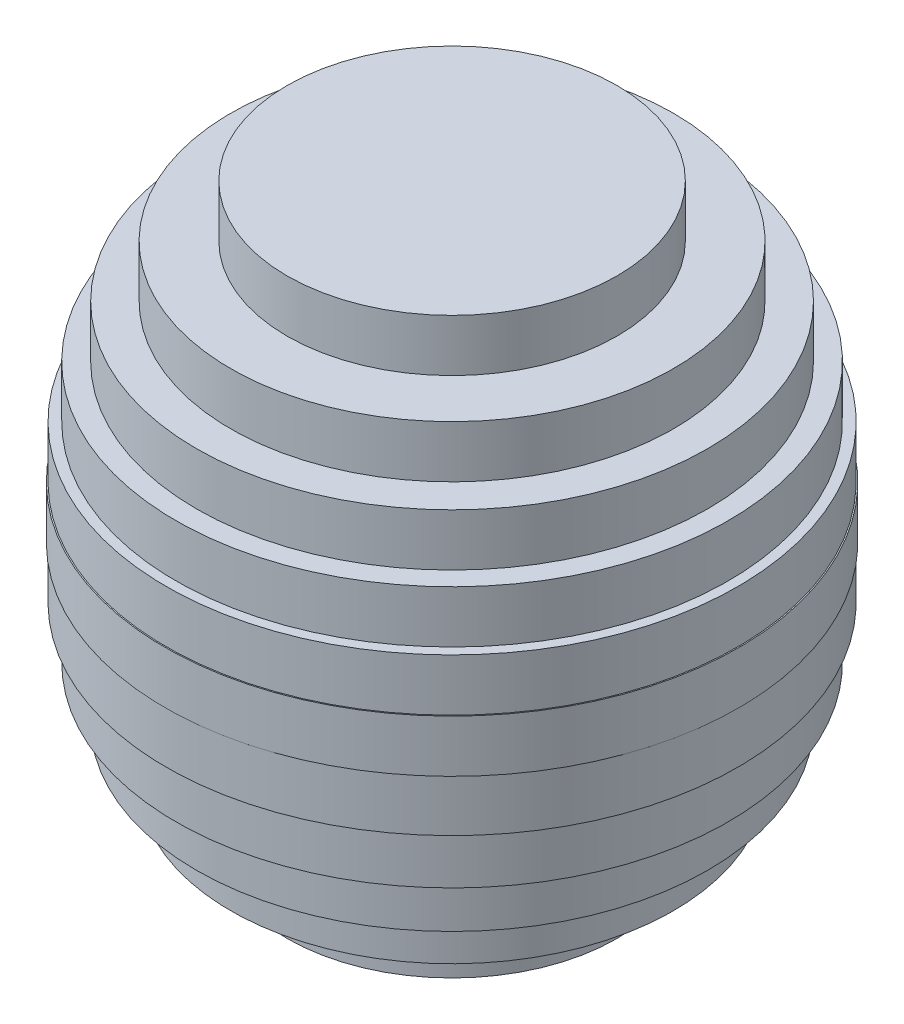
ISO-10303-21;
HEADER;
FILE_DESCRIPTION(('STEP AP214'),'2;1');
FILE_NAME('part.step','',(''),(''),'','','');
FILE_SCHEMA(('AUTOMOTIVE_DESIGN { 1 0 10303 214 1 1 1 1 }'));
ENDSEC;
DATA;
#1=APPLICATION_CONTEXT('core data for automotive mechanical design processes');
#2=APPLICATION_PROTOCOL_DEFINITION('international standard','automotive_design',2000,#1);
#3=PRODUCT_CONTEXT('',#1,'mechanical');
#4=PRODUCT('Part','Part','',(#3));
#5=PRODUCT_RELATED_PRODUCT_CATEGORY('part','',(#4));
#6=PRODUCT_DEFINITION_FORMATION('','',#4);
#7=PRODUCT_DEFINITION_CONTEXT('part definition',#1,'design');
#8=PRODUCT_DEFINITION('design','',#6,#7);
#9=PRODUCT_DEFINITION_SHAPE('','',#8);
#10=(LENGTH_UNIT() NAMED_UNIT(*) SI_UNIT(.MILLI.,.METRE.));
#11=(NAMED_UNIT(*) PLANE_ANGLE_UNIT() SI_UNIT($,.RADIAN.));
#12=(NAMED_UNIT(*) SI_UNIT($,.STERADIAN.) SOLID_ANGLE_UNIT());
#13=UNCERTAINTY_MEASURE_WITH_UNIT(LENGTH_MEASURE(1.E-05),#10,'distance_accuracy_value','');
#14=(GEOMETRIC_REPRESENTATION_CONTEXT(3) GLOBAL_UNCERTAINTY_ASSIGNED_CONTEXT((#13)) GLOBAL_UNIT_ASSIGNED_CONTEXT((#10,
#11,#12)) REPRESENTATION_CONTEXT('',''));
#15=CARTESIAN_POINT('',(0.,0.,0.));
#16=DIRECTION('',(0.,0.,1.));
#17=DIRECTION('',(1.,0.,0.));
#18=AXIS2_PLACEMENT_3D('',#15,#16,#17);
#19=CARTESIAN_POINT('',(27.3861278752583,2.49999999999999,0.));
#20=DIRECTION('',(0.,1.,0.));
#21=DIRECTION('',(0.,0.,1.));
#22=AXIS2_PLACEMENT_3D('',#19,#20,#21);
#23=PLANE('',#22);
#24=CARTESIAN_POINT('',(0.,2.49999999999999,0.));
#25=DIRECTION('',(0.,-1.,0.));
#26=DIRECTION('',(0.,0.,-1.));
#27=AXIS2_PLACEMENT_3D('',#24,#25,#26);
#28=CIRCLE('',#27,27.3861278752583);
#29=CARTESIAN_POINT('',(0.,2.49999999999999,-27.3861278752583));
#30=VERTEX_POINT('',#29);
#31=EDGE_CURVE('E100',#30,#30,#28,.T.);
#32=ORIENTED_EDGE('',*,*,#31,.T.);
#33=EDGE_LOOP('',(#32));
#34=FACE_BOUND('',#33,.T.);
#35=CARTESIAN_POINT('',(0.,2.49999999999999,0.));
#36=DIRECTION('',(0.,-1.,0.));
#37=DIRECTION('',(0.,0.,-1.));
#38=AXIS2_PLACEMENT_3D('',#35,#36,#37);
#39=CIRCLE('',#38,27.4999999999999);
#40=CARTESIAN_POINT('',(0.,2.49999999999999,-27.4999999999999));
#41=VERTEX_POINT('',#40);
#42=EDGE_CURVE('E10',#41,#41,#39,.T.);
#43=ORIENTED_EDGE('',*,*,#42,.F.);
#44=EDGE_LOOP('',(#43));
#45=FACE_BOUND('',#44,.T.);
#46=ADVANCED_FACE('F30',(#34,#45),#23,.T.);
#47=CARTESIAN_POINT('',(0.,-27.5,0.));
#48=DIRECTION('',(0.,-1.,0.));
#49=DIRECTION('',(0.,0.,-1.));
#50=AXIS2_PLACEMENT_3D('',#47,#48,#49);
#51=CYLINDRICAL_SURFACE('',#50,27.4999999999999);
#52=ORIENTED_EDGE('',*,*,#42,.T.);
#53=EDGE_LOOP('',(#52));
#54=FACE_BOUND('',#53,.T.);
#55=CARTESIAN_POINT('',(0.,-2.50000000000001,0.));
#56=DIRECTION('',(0.,-1.,0.));
#57=DIRECTION('',(0.,0.,-1.));
#58=AXIS2_PLACEMENT_3D('',#55,#56,#57);
#59=CIRCLE('',#58,27.4999999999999);
#60=CARTESIAN_POINT('',(0.,-2.50000000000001,-27.4999999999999));
#61=VERTEX_POINT('',#60);
#62=EDGE_CURVE('E36',#61,#61,#59,.T.);
#63=ORIENTED_EDGE('',*,*,#62,.F.);
#64=EDGE_LOOP('',(#63));
#65=FACE_BOUND('',#64,.T.);
#66=ADVANCED_FACE('F118',(#54,#65),#51,.T.);
#67=CARTESIAN_POINT('',(27.4999999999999,-2.50000000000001,0.));
#68=DIRECTION('',(0.,-1.,0.));
#69=DIRECTION('',(0.,0.,-1.));
#70=AXIS2_PLACEMENT_3D('',#67,#68,#69);
#71=PLANE('',#70);
#72=ORIENTED_EDGE('',*,*,#62,.T.);
#73=EDGE_LOOP('',(#72));
#74=FACE_BOUND('',#73,.T.);
#75=CARTESIAN_POINT('',(0.,-2.50000000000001,0.));
#76=DIRECTION('',(0.,-1.,0.));
#77=DIRECTION('',(0.,0.,-1.));
#78=AXIS2_PLACEMENT_3D('',#75,#76,#77);
#79=CIRCLE('',#78,27.3861278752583);
#80=CARTESIAN_POINT('',(0.,-2.50000000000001,-27.3861278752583));
#81=VERTEX_POINT('',#80);
#82=EDGE_CURVE('E40',#81,#81,#79,.T.);
#83=ORIENTED_EDGE('',*,*,#82,.F.);
#84=EDGE_LOOP('',(#83));
#85=FACE_BOUND('',#84,.T.);
#86=ADVANCED_FACE('F122',(#74,#85),#71,.T.);
#87=CARTESIAN_POINT('',(0.,-27.5,0.));
#88=DIRECTION('',(0.,-1.,0.));
#89=DIRECTION('',(0.,0.,-1.));
#90=AXIS2_PLACEMENT_3D('',#87,#88,#89);
#91=CYLINDRICAL_SURFACE('',#90,27.3861278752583);
#92=ORIENTED_EDGE('',*,*,#82,.T.);
#93=EDGE_LOOP('',(#92));
#94=FACE_BOUND('',#93,.T.);
#95=CARTESIAN_POINT('',(0.,-7.50000000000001,0.));
#96=DIRECTION('',(0.,-1.,0.));
#97=DIRECTION('',(0.,0.,-1.));
#98=AXIS2_PLACEMENT_3D('',#95,#96,#97);
#99=CIRCLE('',#98,27.3861278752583);
#100=CARTESIAN_POINT('',(0.,-7.50000000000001,-27.3861278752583));
#101=VERTEX_POINT('',#100);
#102=EDGE_CURVE('E44',#101,#101,#99,.T.);
#103=ORIENTED_EDGE('',*,*,#102,.F.);
#104=EDGE_LOOP('',(#103));
#105=FACE_BOUND('',#104,.T.);
#106=ADVANCED_FACE('F126',(#94,#105),#91,.T.);
#107=CARTESIAN_POINT('',(27.3861278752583,-7.50000000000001,0.));
#108=DIRECTION('',(0.,-1.,0.));
#109=DIRECTION('',(0.,0.,-1.));
#110=AXIS2_PLACEMENT_3D('',#107,#108,#109);
#111=PLANE('',#110);
#112=ORIENTED_EDGE('',*,*,#102,.T.);
#113=EDGE_LOOP('',(#112));
#114=FACE_BOUND('',#113,.T.);
#115=CARTESIAN_POINT('',(0.,-7.50000000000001,0.));
#116=DIRECTION('',(0.,-1.,0.));
#117=DIRECTION('',(0.,0.,-1.));
#118=AXIS2_PLACEMENT_3D('',#115,#116,#117);
#119=CIRCLE('',#118,26.4575131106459);
#120=CARTESIAN_POINT('',(0.,-7.50000000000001,-26.4575131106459));
#121=VERTEX_POINT('',#120);
#122=EDGE_CURVE('E49',#121,#121,#119,.T.);
#123=ORIENTED_EDGE('',*,*,#122,.F.);
#124=EDGE_LOOP('',(#123));
#125=FACE_BOUND('',#124,.T.);
#126=ADVANCED_FACE('F132',(#114,#125),#111,.T.);
#127=CARTESIAN_POINT('',(0.,-27.5,0.));
#128=DIRECTION('',(0.,-1.,0.));
#129=DIRECTION('',(0.,0.,-1.));
#130=AXIS2_PLACEMENT_3D('',#127,#128,#129);
#131=CYLINDRICAL_SURFACE('',#130,26.4575131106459);
#132=ORIENTED_EDGE('',*,*,#122,.T.);
#133=EDGE_LOOP('',(#132));
#134=FACE_BOUND('',#133,.T.);
#135=CARTESIAN_POINT('',(0.,-12.5,0.));
#136=DIRECTION('',(0.,-1.,0.));
#137=DIRECTION('',(0.,0.,-1.));
#138=AXIS2_PLACEMENT_3D('',#135,#136,#137);
#139=CIRCLE('',#138,26.4575131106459);
#140=CARTESIAN_POINT('',(0.,-12.5,-26.4575131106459));
#141=VERTEX_POINT('',#140);
#142=EDGE_CURVE('E52',#141,#141,#139,.T.);
#143=ORIENTED_EDGE('',*,*,#142,.F.);
#144=EDGE_LOOP('',(#143));
#145=FACE_BOUND('',#144,.T.);
#146=ADVANCED_FACE('F136',(#134,#145),#131,.T.);
#147=CARTESIAN_POINT('',(26.4575131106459,-12.5,0.));
#148=DIRECTION('',(0.,-1.,0.));
#149=DIRECTION('',(0.,0.,-1.));
#150=AXIS2_PLACEMENT_3D('',#147,#148,#149);
#151=PLANE('',#150);
#152=ORIENTED_EDGE('',*,*,#142,.T.);
#153=EDGE_LOOP('',(#152));
#154=FACE_BOUND('',#153,.T.);
#155=CARTESIAN_POINT('',(0.,-12.5,0.));
#156=DIRECTION('',(0.,-1.,0.));
#157=DIRECTION('',(0.,0.,-1.));
#158=AXIS2_PLACEMENT_3D('',#155,#156,#157);
#159=CIRCLE('',#158,24.4948974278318);
#160=CARTESIAN_POINT('',(0.,-12.5,-24.4948974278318));
#161=VERTEX_POINT('',#160);
#162=EDGE_CURVE('E55',#161,#161,#159,.T.);
#163=ORIENTED_EDGE('',*,*,#162,.F.);
#164=EDGE_LOOP('',(#163));
#165=FACE_BOUND('',#164,.T.);
#166=ADVANCED_FACE('F140',(#154,#165),#151,.T.);
#167=CARTESIAN_POINT('',(0.,-27.5,0.));
#168=DIRECTION('',(0.,-1.,0.));
#169=DIRECTION('',(0.,0.,-1.));
#170=AXIS2_PLACEMENT_3D('',#167,#168,#169);
#171=CYLINDRICAL_SURFACE('',#170,24.4948974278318);
#172=ORIENTED_EDGE('',*,*,#162,.T.);
#173=EDGE_LOOP('',(#172));
#174=FACE_BOUND('',#173,.T.);
#175=CARTESIAN_POINT('',(0.,-17.5,0.));
#176=DIRECTION('',(0.,-1.,0.));
#177=DIRECTION('',(0.,0.,-1.));
#178=AXIS2_PLACEMENT_3D('',#175,#176,#177);
#179=CIRCLE('',#178,24.4948974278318);
#180=CARTESIAN_POINT('',(0.,-17.5,-24.4948974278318));
#181=VERTEX_POINT('',#180);
#182=EDGE_CURVE('E58',#181,#181,#179,.T.);
#183=ORIENTED_EDGE('',*,*,#182,.F.);
#184=EDGE_LOOP('',(#183));
#185=FACE_BOUND('',#184,.T.);
#186=ADVANCED_FACE('F144',(#174,#185),#171,.T.);
#187=CARTESIAN_POINT('',(24.4948974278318,-17.5,0.));
#188=DIRECTION('',(0.,-1.,0.));
#189=DIRECTION('',(0.,0.,-1.));
#190=AXIS2_PLACEMENT_3D('',#187,#188,#189);
#191=PLANE('',#190);
#192=ORIENTED_EDGE('',*,*,#182,.T.);
#193=EDGE_LOOP('',(#192));
#194=FACE_BOUND('',#193,.T.);
#195=CARTESIAN_POINT('',(0.,-17.5,0.));
#196=DIRECTION('',(0.,-1.,0.));
#197=DIRECTION('',(0.,0.,-1.));
#198=AXIS2_PLACEMENT_3D('',#195,#196,#197);
#199=CIRCLE('',#198,21.2132034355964);
#200=CARTESIAN_POINT('',(0.,-17.5,-21.2132034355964));
#201=VERTEX_POINT('',#200);
#202=EDGE_CURVE('E61',#201,#201,#199,.T.);
#203=ORIENTED_EDGE('',*,*,#202,.F.);
#204=EDGE_LOOP('',(#203));
#205=FACE_BOUND('',#204,.T.);
#206=ADVANCED_FACE('F148',(#194,#205),#191,.T.);
#207=CARTESIAN_POINT('',(0.,-27.5,0.));
#208=DIRECTION('',(0.,-1.,0.));
#209=DIRECTION('',(0.,0.,-1.));
#210=AXIS2_PLACEMENT_3D('',#207,#208,#209);
#211=CYLINDRICAL_SURFACE('',#210,21.2132034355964);
#212=ORIENTED_EDGE('',*,*,#202,.T.);
#213=EDGE_LOOP('',(#212));
#214=FACE_BOUND('',#213,.T.);
#215=CARTESIAN_POINT('',(0.,-22.5,0.));
#216=DIRECTION('',(0.,-1.,0.));
#217=DIRECTION('',(0.,0.,-1.));
#218=AXIS2_PLACEMENT_3D('',#215,#216,#217);
#219=CIRCLE('',#218,21.2132034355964);
#220=CARTESIAN_POINT('',(0.,-22.5,-21.2132034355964));
#221=VERTEX_POINT('',#220);
#222=EDGE_CURVE('E64',#221,#221,#219,.T.);
#223=ORIENTED_EDGE('',*,*,#222,.F.);
#224=EDGE_LOOP('',(#223));
#225=FACE_BOUND('',#224,.T.);
#226=ADVANCED_FACE('F152',(#214,#225),#211,.T.);
#227=CARTESIAN_POINT('',(21.2132034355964,-22.5,0.));
#228=DIRECTION('',(0.,-1.,0.));
#229=DIRECTION('',(0.,0.,-1.));
#230=AXIS2_PLACEMENT_3D('',#227,#228,#229);
#231=PLANE('',#230);
#232=ORIENTED_EDGE('',*,*,#222,.T.);
#233=EDGE_LOOP('',(#232));
#234=FACE_BOUND('',#233,.T.);
#235=CARTESIAN_POINT('',(0.,-22.5,0.));
#236=DIRECTION('',(0.,-1.,0.));
#237=DIRECTION('',(0.,0.,-1.));
#238=AXIS2_PLACEMENT_3D('',#235,#236,#237);
#239=CIRCLE('',#238,15.8113883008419);
#240=CARTESIAN_POINT('',(0.,-22.5,-15.8113883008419));
#241=VERTEX_POINT('',#240);
#242=EDGE_CURVE('E67',#241,#241,#239,.T.);
#243=ORIENTED_EDGE('',*,*,#242,.F.);
#244=EDGE_LOOP('',(#243));
#245=FACE_BOUND('',#244,.T.);
#246=ADVANCED_FACE('F156',(#234,#245),#231,.T.);
#247=CARTESIAN_POINT('',(0.,-27.5,0.));
#248=DIRECTION('',(0.,-1.,0.));
#249=DIRECTION('',(0.,0.,-1.));
#250=AXIS2_PLACEMENT_3D('',#247,#248,#249);
#251=CYLINDRICAL_SURFACE('',#250,15.8113883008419);
#252=ORIENTED_EDGE('',*,*,#242,.T.);
#253=EDGE_LOOP('',(#252));
#254=FACE_BOUND('',#253,.T.);
#255=CARTESIAN_POINT('',(0.,-27.5,0.));
#256=DIRECTION('',(0.,-1.,0.));
#257=DIRECTION('',(0.,0.,-1.));
#258=AXIS2_PLACEMENT_3D('',#255,#256,#257);
#259=CIRCLE('',#258,15.8113883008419);
#260=CARTESIAN_POINT('',(0.,-27.5,-15.8113883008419));
#261=VERTEX_POINT('',#260);
#262=EDGE_CURVE('E70',#261,#261,#259,.T.);
#263=ORIENTED_EDGE('',*,*,#262,.F.);
#264=EDGE_LOOP('',(#263));
#265=FACE_BOUND('',#264,.T.);
#266=ADVANCED_FACE('F160',(#254,#265),#251,.T.);
#267=CARTESIAN_POINT('',(15.8113883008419,-27.5,0.));
#268=DIRECTION('',(0.,-1.,0.));
#269=DIRECTION('',(0.,0.,-1.));
#270=AXIS2_PLACEMENT_3D('',#267,#268,#269);
#271=PLANE('',#270);
#272=ORIENTED_EDGE('',*,*,#262,.T.);
#273=EDGE_LOOP('',(#272));
#274=FACE_BOUND('',#273,.T.);
#275=ADVANCED_FACE('F164',(#274),#271,.T.);
#276=CARTESIAN_POINT('',(0.,27.5,0.));
#277=DIRECTION('',(0.,1.,0.));
#278=DIRECTION('',(0.,0.,1.));
#279=AXIS2_PLACEMENT_3D('',#276,#277,#278);
#280=PLANE('',#279);
#281=CARTESIAN_POINT('',(0.,27.5,0.));
#282=DIRECTION('',(0.,-1.,0.));
#283=DIRECTION('',(0.,0.,-1.));
#284=AXIS2_PLACEMENT_3D('',#281,#282,#283);
#285=CIRCLE('',#284,15.8113883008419);
#286=CARTESIAN_POINT('',(0.,27.5,-15.8113883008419));
#287=VERTEX_POINT('',#286);
#288=EDGE_CURVE('E73',#287,#287,#285,.T.);
#289=ORIENTED_EDGE('',*,*,#288,.F.);
#290=EDGE_LOOP('',(#289));
#291=FACE_BOUND('',#290,.T.);
#292=ADVANCED_FACE('F168',(#291),#280,.T.);
#293=CARTESIAN_POINT('',(0.,-27.5,0.));
#294=DIRECTION('',(0.,-1.,0.));
#295=DIRECTION('',(0.,0.,-1.));
#296=AXIS2_PLACEMENT_3D('',#293,#294,#295);
#297=CYLINDRICAL_SURFACE('',#296,15.8113883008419);
#298=ORIENTED_EDGE('',*,*,#288,.T.);
#299=EDGE_LOOP('',(#298));
#300=FACE_BOUND('',#299,.T.);
#301=CARTESIAN_POINT('',(0.,22.5,0.));
#302=DIRECTION('',(0.,-1.,0.));
#303=DIRECTION('',(0.,0.,-1.));
#304=AXIS2_PLACEMENT_3D('',#301,#302,#303);
#305=CIRCLE('',#304,15.8113883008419);
#306=CARTESIAN_POINT('',(0.,22.5,-15.8113883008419));
#307=VERTEX_POINT('',#306);
#308=EDGE_CURVE('E76',#307,#307,#305,.T.);
#309=ORIENTED_EDGE('',*,*,#308,.F.);
#310=EDGE_LOOP('',(#309));
#311=FACE_BOUND('',#310,.T.);
#312=ADVANCED_FACE('F172',(#300,#311),#297,.T.);
#313=CARTESIAN_POINT('',(15.8113883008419,22.5,0.));
#314=DIRECTION('',(0.,1.,0.));
#315=DIRECTION('',(0.,0.,1.));
#316=AXIS2_PLACEMENT_3D('',#313,#314,#315);
#317=PLANE('',#316);
#318=ORIENTED_EDGE('',*,*,#308,.T.);
#319=EDGE_LOOP('',(#318));
#320=FACE_BOUND('',#319,.T.);
#321=CARTESIAN_POINT('',(0.,22.5,0.));
#322=DIRECTION('',(0.,-1.,0.));
#323=DIRECTION('',(0.,0.,-1.));
#324=AXIS2_PLACEMENT_3D('',#321,#322,#323);
#325=CIRCLE('',#324,21.2132034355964);
#326=CARTESIAN_POINT('',(0.,22.5,-21.2132034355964));
#327=VERTEX_POINT('',#326);
#328=EDGE_CURVE('E79',#327,#327,#325,.T.);
#329=ORIENTED_EDGE('',*,*,#328,.F.);
#330=EDGE_LOOP('',(#329));
#331=FACE_BOUND('',#330,.T.);
#332=ADVANCED_FACE('F176',(#320,#331),#317,.T.);
#333=CARTESIAN_POINT('',(0.,-27.5,0.));
#334=DIRECTION('',(0.,-1.,0.));
#335=DIRECTION('',(0.,0.,-1.));
#336=AXIS2_PLACEMENT_3D('',#333,#334,#335);
#337=CYLINDRICAL_SURFACE('',#336,21.2132034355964);
#338=ORIENTED_EDGE('',*,*,#328,.T.);
#339=EDGE_LOOP('',(#338));
#340=FACE_BOUND('',#339,.T.);
#341=CARTESIAN_POINT('',(0.,17.5,0.));
#342=DIRECTION('',(0.,-1.,0.));
#343=DIRECTION('',(0.,0.,-1.));
#344=AXIS2_PLACEMENT_3D('',#341,#342,#343);
#345=CIRCLE('',#344,21.2132034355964);
#346=CARTESIAN_POINT('',(0.,17.5,-21.2132034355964));
#347=VERTEX_POINT('',#346);
#348=EDGE_CURVE('E82',#347,#347,#345,.T.);
#349=ORIENTED_EDGE('',*,*,#348,.F.);
#350=EDGE_LOOP('',(#349));
#351=FACE_BOUND('',#350,.T.);
#352=ADVANCED_FACE('F180',(#340,#351),#337,.T.);
#353=CARTESIAN_POINT('',(21.2132034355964,17.5,0.));
#354=DIRECTION('',(0.,1.,0.));
#355=DIRECTION('',(0.,0.,1.));
#356=AXIS2_PLACEMENT_3D('',#353,#354,#355);
#357=PLANE('',#356);
#358=ORIENTED_EDGE('',*,*,#348,.T.);
#359=EDGE_LOOP('',(#358));
#360=FACE_BOUND('',#359,.T.);
#361=CARTESIAN_POINT('',(0.,17.5,0.));
#362=DIRECTION('',(0.,-1.,0.));
#363=DIRECTION('',(0.,0.,-1.));
#364=AXIS2_PLACEMENT_3D('',#361,#362,#363);
#365=CIRCLE('',#364,24.4948974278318);
#366=CARTESIAN_POINT('',(0.,17.5,-24.4948974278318));
#367=VERTEX_POINT('',#366);
#368=EDGE_CURVE('E85',#367,#367,#365,.T.);
#369=ORIENTED_EDGE('',*,*,#368,.F.);
#370=EDGE_LOOP('',(#369));
#371=FACE_BOUND('',#370,.T.);
#372=ADVANCED_FACE('F184',(#360,#371),#357,.T.);
#373=CARTESIAN_POINT('',(0.,-27.5,0.));
#374=DIRECTION('',(0.,-1.,0.));
#375=DIRECTION('',(0.,0.,-1.));
#376=AXIS2_PLACEMENT_3D('',#373,#374,#375);
#377=CYLINDRICAL_SURFACE('',#376,24.4948974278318);
#378=ORIENTED_EDGE('',*,*,#368,.T.);
#379=EDGE_LOOP('',(#378));
#380=FACE_BOUND('',#379,.T.);
#381=CARTESIAN_POINT('',(0.,12.5,0.));
#382=DIRECTION('',(0.,-1.,0.));
#383=DIRECTION('',(0.,0.,-1.));
#384=AXIS2_PLACEMENT_3D('',#381,#382,#383);
#385=CIRCLE('',#384,24.4948974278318);
#386=CARTESIAN_POINT('',(0.,12.5,-24.4948974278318));
#387=VERTEX_POINT('',#386);
#388=EDGE_CURVE('E88',#387,#387,#385,.T.);
#389=ORIENTED_EDGE('',*,*,#388,.F.);
#390=EDGE_LOOP('',(#389));
#391=FACE_BOUND('',#390,.T.);
#392=ADVANCED_FACE('F188',(#380,#391),#377,.T.);
#393=CARTESIAN_POINT('',(24.4948974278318,12.5,0.));
#394=DIRECTION('',(0.,1.,0.));
#395=DIRECTION('',(0.,0.,1.));
#396=AXIS2_PLACEMENT_3D('',#393,#394,#395);
#397=PLANE('',#396);
#398=ORIENTED_EDGE('',*,*,#388,.T.);
#399=EDGE_LOOP('',(#398));
#400=FACE_BOUND('',#399,.T.);
#401=CARTESIAN_POINT('',(0.,12.5,0.));
#402=DIRECTION('',(0.,-1.,0.));
#403=DIRECTION('',(0.,0.,-1.));
#404=AXIS2_PLACEMENT_3D('',#401,#402,#403);
#405=CIRCLE('',#404,26.4575131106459);
#406=CARTESIAN_POINT('',(0.,12.5,-26.4575131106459));
#407=VERTEX_POINT('',#406);
#408=EDGE_CURVE('E91',#407,#407,#405,.T.);
#409=ORIENTED_EDGE('',*,*,#408,.F.);
#410=EDGE_LOOP('',(#409));
#411=FACE_BOUND('',#410,.T.);
#412=ADVANCED_FACE('F192',(#400,#411),#397,.T.);
#413=CARTESIAN_POINT('',(0.,-27.5,0.));
#414=DIRECTION('',(0.,-1.,0.));
#415=DIRECTION('',(0.,0.,-1.));
#416=AXIS2_PLACEMENT_3D('',#413,#414,#415);
#417=CYLINDRICAL_SURFACE('',#416,26.4575131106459);
#418=ORIENTED_EDGE('',*,*,#408,.T.);
#419=EDGE_LOOP('',(#418));
#420=FACE_BOUND('',#419,.T.);
#421=CARTESIAN_POINT('',(0.,7.49999999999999,0.));
#422=DIRECTION('',(0.,-1.,0.));
#423=DIRECTION('',(0.,0.,-1.));
#424=AXIS2_PLACEMENT_3D('',#421,#422,#423);
#425=CIRCLE('',#424,26.4575131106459);
#426=CARTESIAN_POINT('',(0.,7.49999999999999,-26.4575131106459));
#427=VERTEX_POINT('',#426);
#428=EDGE_CURVE('E94',#427,#427,#425,.T.);
#429=ORIENTED_EDGE('',*,*,#428,.F.);
#430=EDGE_LOOP('',(#429));
#431=FACE_BOUND('',#430,.T.);
#432=ADVANCED_FACE('F114',(#420,#431),#417,.T.);
#433=CARTESIAN_POINT('',(26.4575131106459,7.49999999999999,0.));
#434=DIRECTION('',(0.,1.,0.));
#435=DIRECTION('',(0.,0.,1.));
#436=AXIS2_PLACEMENT_3D('',#433,#434,#435);
#437=PLANE('',#436);
#438=ORIENTED_EDGE('',*,*,#428,.T.);
#439=EDGE_LOOP('',(#438));
#440=FACE_BOUND('',#439,.T.);
#441=CARTESIAN_POINT('',(0.,7.49999999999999,0.));
#442=DIRECTION('',(0.,-1.,0.));
#443=DIRECTION('',(0.,0.,-1.));
#444=AXIS2_PLACEMENT_3D('',#441,#442,#443);
#445=CIRCLE('',#444,27.3861278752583);
#446=CARTESIAN_POINT('',(0.,7.49999999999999,-27.3861278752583));
#447=VERTEX_POINT('',#446);
#448=EDGE_CURVE('E97',#447,#447,#445,.T.);
#449=ORIENTED_EDGE('',*,*,#448,.F.);
#450=EDGE_LOOP('',(#449));
#451=FACE_BOUND('',#450,.T.);
#452=ADVANCED_FACE('F108',(#440,#451),#437,.T.);
#453=CARTESIAN_POINT('',(0.,-27.5,0.));
#454=DIRECTION('',(0.,-1.,0.));
#455=DIRECTION('',(0.,0.,-1.));
#456=AXIS2_PLACEMENT_3D('',#453,#454,#455);
#457=CYLINDRICAL_SURFACE('',#456,27.3861278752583);
#458=ORIENTED_EDGE('',*,*,#448,.T.);
#459=EDGE_LOOP('',(#458));
#460=FACE_BOUND('',#459,.T.);
#461=ORIENTED_EDGE('',*,*,#31,.F.);
#462=EDGE_LOOP('',(#461));
#463=FACE_BOUND('',#462,.T.);
#464=ADVANCED_FACE('F106',(#460,#463),#457,.T.);
#465=CLOSED_SHELL('',(#46,#66,#86,#106,#126,#146,#166,#186,#206,#226,#246,#266,#275,#292,#312,
#332,#352,#372,#392,#412,#432,#452,#464));
#466=MANIFOLD_SOLID_BREP('B2',#465);
#467=ADVANCED_BREP_SHAPE_REPRESENTATION('',(#18,#466),#14);
#468=SHAPE_DEFINITION_REPRESENTATION(#9,#467);
ENDSEC;
END-ISO-10303-21;
